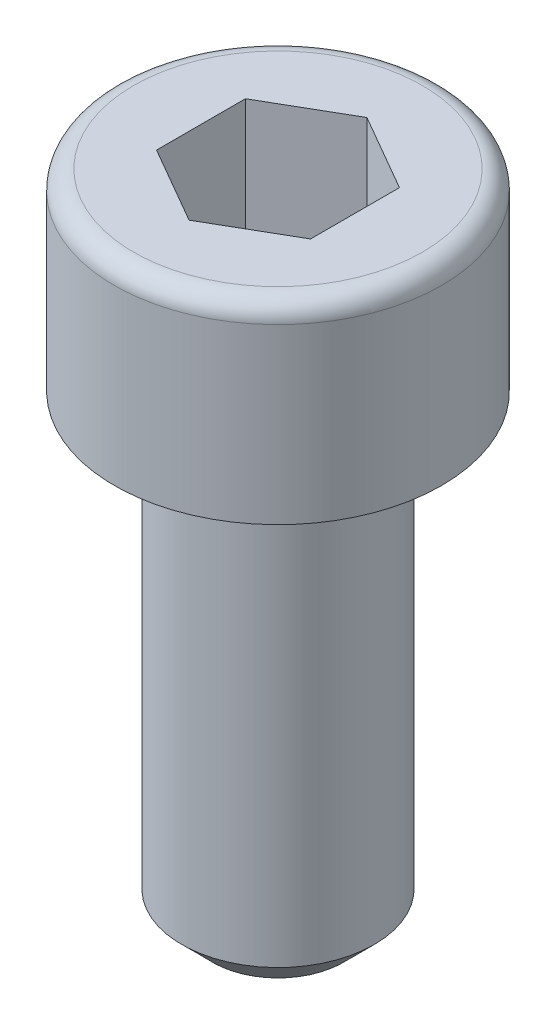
ISO-10303-21;
HEADER;
FILE_DESCRIPTION(('STEP AP214'),'2;1');
FILE_NAME('part.step','',(''),(''),'','','');
FILE_SCHEMA(('AUTOMOTIVE_DESIGN { 1 0 10303 214 1 1 1 1 }'));
ENDSEC;
DATA;
#1=APPLICATION_CONTEXT('core data for automotive mechanical design processes');
#2=APPLICATION_PROTOCOL_DEFINITION('international standard','automotive_design',2000,#1);
#3=PRODUCT_CONTEXT('',#1,'mechanical');
#4=PRODUCT('Part','Part','',(#3));
#5=PRODUCT_RELATED_PRODUCT_CATEGORY('part','',(#4));
#6=PRODUCT_DEFINITION_FORMATION('','',#4);
#7=PRODUCT_DEFINITION_CONTEXT('part definition',#1,'design');
#8=PRODUCT_DEFINITION('design','',#6,#7);
#9=PRODUCT_DEFINITION_SHAPE('','',#8);
#10=(LENGTH_UNIT() NAMED_UNIT(*) SI_UNIT(.MILLI.,.METRE.));
#11=(NAMED_UNIT(*) PLANE_ANGLE_UNIT() SI_UNIT($,.RADIAN.));
#12=(NAMED_UNIT(*) SI_UNIT($,.STERADIAN.) SOLID_ANGLE_UNIT());
#13=UNCERTAINTY_MEASURE_WITH_UNIT(LENGTH_MEASURE(1.E-05),#10,'distance_accuracy_value','');
#14=(GEOMETRIC_REPRESENTATION_CONTEXT(3) GLOBAL_UNCERTAINTY_ASSIGNED_CONTEXT((#13)) GLOBAL_UNIT_ASSIGNED_CONTEXT((#10,
#11,#12)) REPRESENTATION_CONTEXT('',''));
#15=CARTESIAN_POINT('',(0.,0.,0.));
#16=DIRECTION('',(0.,0.,1.));
#17=DIRECTION('',(1.,0.,0.));
#18=AXIS2_PLACEMENT_3D('',#15,#16,#17);
#19=CARTESIAN_POINT('',(1.70000000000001,-17.,0.));
#20=DIRECTION('',(0.,-1.,0.));
#21=DIRECTION('',(1.,0.,0.));
#22=AXIS2_PLACEMENT_3D('',#19,#20,#21);
#23=PLANE('',#22);
#24=CARTESIAN_POINT('',(0.,-17.,0.));
#25=DIRECTION('',(0.,1.,0.));
#26=DIRECTION('',(-1.,0.,0.));
#27=AXIS2_PLACEMENT_3D('',#24,#25,#26);
#28=CIRCLE('',#27,1.7);
#29=CARTESIAN_POINT('',(-1.69999999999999,-17.,0.));
#30=VERTEX_POINT('',#29);
#31=EDGE_CURVE('E11',#30,#30,#28,.T.);
#32=ORIENTED_EDGE('',*,*,#31,.F.);
#33=EDGE_LOOP('',(#32));
#34=FACE_BOUND('',#33,.T.);
#35=ADVANCED_FACE('F32',(#34),#23,.T.);
#36=CARTESIAN_POINT('',(0.,-17.,0.));
#37=DIRECTION('',(0.,1.,0.));
#38=DIRECTION('',(-1.,0.,0.));
#39=AXIS2_PLACEMENT_3D('',#36,#37,#38);
#40=CONICAL_SURFACE('',#39,1.7,0.785398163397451);
#41=CARTESIAN_POINT('',(0.,-16.2,0.));
#42=DIRECTION('',(0.,1.,0.));
#43=DIRECTION('',(-1.,0.,0.));
#44=AXIS2_PLACEMENT_3D('',#41,#42,#43);
#45=CIRCLE('',#44,2.5);
#46=CARTESIAN_POINT('',(-2.49999999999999,-16.2,0.));
#47=VERTEX_POINT('',#46);
#48=EDGE_CURVE('E39',#47,#47,#45,.T.);
#49=ORIENTED_EDGE('',*,*,#48,.F.);
#50=EDGE_LOOP('',(#49));
#51=FACE_BOUND('',#50,.T.);
#52=ORIENTED_EDGE('',*,*,#31,.T.);
#53=EDGE_LOOP('',(#52));
#54=FACE_BOUND('',#53,.T.);
#55=ADVANCED_FACE('F134',(#51,#54),#40,.T.);
#56=CARTESIAN_POINT('',(0.,65.1172922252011,0.));
#57=DIRECTION('',(0.,1.,0.));
#58=DIRECTION('',(-1.,0.,0.));
#59=AXIS2_PLACEMENT_3D('',#56,#57,#58);
#60=CYLINDRICAL_SURFACE('',#59,2.49999999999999);
#61=ORIENTED_EDGE('',*,*,#48,.T.);
#62=EDGE_LOOP('',(#61));
#63=FACE_BOUND('',#62,.T.);
#64=CARTESIAN_POINT('',(0.,-5.,0.));
#65=DIRECTION('',(0.,1.,0.));
#66=DIRECTION('',(-1.,0.,0.));
#67=AXIS2_PLACEMENT_3D('',#64,#65,#66);
#68=CIRCLE('',#67,2.49999999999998);
#69=CARTESIAN_POINT('',(-2.49999999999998,-5.00000000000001,0.));
#70=VERTEX_POINT('',#69);
#71=EDGE_CURVE('E126',#70,#70,#68,.T.);
#72=ORIENTED_EDGE('',*,*,#71,.F.);
#73=EDGE_LOOP('',(#72));
#74=FACE_BOUND('',#73,.T.);
#75=ADVANCED_FACE('F131',(#63,#74),#60,.T.);
#76=CARTESIAN_POINT('',(2.49999999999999,-5.,0.));
#77=DIRECTION('',(0.,1.,0.));
#78=DIRECTION('',(-1.,0.,0.));
#79=AXIS2_PLACEMENT_3D('',#76,#77,#78);
#80=PLANE('',#79);
#81=CARTESIAN_POINT('',(0.,-5.,0.));
#82=DIRECTION('',(0.,1.,0.));
#83=DIRECTION('',(-1.,0.,0.));
#84=AXIS2_PLACEMENT_3D('',#81,#82,#83);
#85=CIRCLE('',#84,4.24999999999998);
#86=CARTESIAN_POINT('',(-4.24999999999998,-5.00000000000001,0.));
#87=VERTEX_POINT('',#86);
#88=EDGE_CURVE('E123',#87,#87,#85,.T.);
#89=ORIENTED_EDGE('',*,*,#88,.F.);
#90=EDGE_LOOP('',(#89));
#91=FACE_BOUND('',#90,.T.);
#92=ORIENTED_EDGE('',*,*,#71,.T.);
#93=EDGE_LOOP('',(#92));
#94=FACE_BOUND('',#93,.T.);
#95=ADVANCED_FACE('F152',(#91,#94),#80,.F.);
#96=CARTESIAN_POINT('',(0.,65.1172922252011,0.));
#97=DIRECTION('',(0.,1.,0.));
#98=DIRECTION('',(-1.,0.,0.));
#99=AXIS2_PLACEMENT_3D('',#96,#97,#98);
#100=CYLINDRICAL_SURFACE('',#99,4.24999999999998);
#101=CARTESIAN_POINT('',(0.,-0.5,0.));
#102=DIRECTION('',(0.,1.,0.));
#103=DIRECTION('',(-1.,0.,0.));
#104=AXIS2_PLACEMENT_3D('',#101,#102,#103);
#105=CIRCLE('',#104,4.24999999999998);
#106=CARTESIAN_POINT('',(-4.24999999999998,-0.500000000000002,0.));
#107=VERTEX_POINT('',#106);
#108=EDGE_CURVE('E120',#107,#107,#105,.T.);
#109=ORIENTED_EDGE('',*,*,#108,.F.);
#110=EDGE_LOOP('',(#109));
#111=FACE_BOUND('',#110,.T.);
#112=ORIENTED_EDGE('',*,*,#88,.T.);
#113=EDGE_LOOP('',(#112));
#114=FACE_BOUND('',#113,.T.);
#115=ADVANCED_FACE('F159',(#111,#114),#100,.T.);
#116=CARTESIAN_POINT('',(0.,-0.5,0.));
#117=DIRECTION('',(0.,1.,0.));
#118=DIRECTION('',(-1.,0.,0.));
#119=AXIS2_PLACEMENT_3D('',#116,#117,#118);
#120=TOROIDAL_SURFACE('',#119,3.74999999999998,0.5);
#121=CARTESIAN_POINT('',(0.,0.,0.));
#122=DIRECTION('',(0.,1.,0.));
#123=DIRECTION('',(-1.,0.,0.));
#124=AXIS2_PLACEMENT_3D('',#121,#122,#123);
#125=CIRCLE('',#124,3.74999999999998);
#126=CARTESIAN_POINT('',(-3.74999999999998,0.,0.));
#127=VERTEX_POINT('',#126);
#128=EDGE_CURVE('E109',#127,#127,#125,.T.);
#129=ORIENTED_EDGE('',*,*,#128,.F.);
#130=EDGE_LOOP('',(#129));
#131=FACE_BOUND('',#130,.T.);
#132=ORIENTED_EDGE('',*,*,#108,.T.);
#133=EDGE_LOOP('',(#132));
#134=FACE_BOUND('',#133,.T.);
#135=ADVANCED_FACE('F167',(#131,#134),#120,.T.);
#136=CARTESIAN_POINT('',(3.75,0.,0.));
#137=DIRECTION('',(0.,-1.,0.));
#138=DIRECTION('',(1.,0.,0.));
#139=AXIS2_PLACEMENT_3D('',#136,#137,#138);
#140=PLANE('',#139);
#141=DIRECTION('',(0.,0.,1.));
#142=VECTOR('',#141,1.);
#143=CARTESIAN_POINT('',(-2.,0.,-1.15470053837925));
#144=LINE('',#143,#142);
#145=CARTESIAN_POINT('',(-2.,0.,-1.15470053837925));
#146=VERTEX_POINT('',#145);
#147=CARTESIAN_POINT('',(-2.,0.,1.15470053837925));
#148=VERTEX_POINT('',#147);
#149=EDGE_CURVE('E343',#146,#148,#144,.T.);
#150=ORIENTED_EDGE('',*,*,#149,.F.);
#151=DIRECTION('',(-0.866025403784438,0.,0.500000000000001));
#152=VECTOR('',#151,1.);
#153=CARTESIAN_POINT('',(0.,0.,-2.3094010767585));
#154=LINE('',#153,#152);
#155=CARTESIAN_POINT('',(0.,0.,-2.3094010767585));
#156=VERTEX_POINT('',#155);
#157=EDGE_CURVE('E46',#156,#146,#154,.T.);
#158=ORIENTED_EDGE('',*,*,#157,.F.);
#159=DIRECTION('',(0.866025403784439,0.,0.500000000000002));
#160=VECTOR('',#159,1.);
#161=CARTESIAN_POINT('',(0.,0.,-2.3094010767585));
#162=LINE('',#161,#160);
#163=CARTESIAN_POINT('',(2.,0.,-1.15470053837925));
#164=VERTEX_POINT('',#163);
#165=EDGE_CURVE('E82',#156,#164,#162,.T.);
#166=ORIENTED_EDGE('',*,*,#165,.T.);
#167=DIRECTION('',(0.,0.,1.));
#168=VECTOR('',#167,1.);
#169=CARTESIAN_POINT('',(2.,0.,-1.15470053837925));
#170=LINE('',#169,#168);
#171=CARTESIAN_POINT('',(2.,0.,1.15470053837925));
#172=VERTEX_POINT('',#171);
#173=EDGE_CURVE('E91',#164,#172,#170,.T.);
#174=ORIENTED_EDGE('',*,*,#173,.T.);
#175=DIRECTION('',(-0.866025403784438,0.,0.500000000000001));
#176=VECTOR('',#175,1.);
#177=CARTESIAN_POINT('',(2.,0.,1.15470053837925));
#178=LINE('',#177,#176);
#179=CARTESIAN_POINT('',(0.,0.,2.3094010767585));
#180=VERTEX_POINT('',#179);
#181=EDGE_CURVE('E97',#172,#180,#178,.T.);
#182=ORIENTED_EDGE('',*,*,#181,.T.);
#183=DIRECTION('',(0.866025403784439,0.,0.500000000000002));
#184=VECTOR('',#183,1.);
#185=CARTESIAN_POINT('',(-2.,0.,1.15470053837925));
#186=LINE('',#185,#184);
#187=EDGE_CURVE('E355',#148,#180,#186,.T.);
#188=ORIENTED_EDGE('',*,*,#187,.F.);
#189=EDGE_LOOP('',(#150,#158,#166,#174,#182,#188));
#190=FACE_BOUND('',#189,.T.);
#191=ORIENTED_EDGE('',*,*,#128,.T.);
#192=EDGE_LOOP('',(#191));
#193=FACE_BOUND('',#192,.T.);
#194=ADVANCED_FACE('F100',(#190,#193),#140,.F.);
#195=CARTESIAN_POINT('',(0.,-3.6,-2.3094010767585));
#196=DIRECTION('',(-0.500000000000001,0.,-0.866025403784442));
#197=DIRECTION('',(-0.866025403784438,0.,0.500000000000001));
#198=AXIS2_PLACEMENT_3D('',#195,#196,#197);
#199=PLANE('',#198);
#200=ORIENTED_EDGE('',*,*,#157,.T.);
#201=DIRECTION('',(0.,1.,0.));
#202=VECTOR('',#201,1.);
#203=CARTESIAN_POINT('',(-2.,-3.6,-1.15470053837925));
#204=LINE('',#203,#202);
#205=CARTESIAN_POINT('',(-2.,-3.6,-1.15470053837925));
#206=VERTEX_POINT('',#205);
#207=EDGE_CURVE('E116',#206,#146,#204,.T.);
#208=ORIENTED_EDGE('',*,*,#207,.F.);
#209=DIRECTION('',(-0.866025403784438,0.,0.500000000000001));
#210=VECTOR('',#209,1.);
#211=CARTESIAN_POINT('',(0.,-3.6,-2.3094010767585));
#212=LINE('',#211,#210);
#213=CARTESIAN_POINT('',(0.,-3.6,-2.3094010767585));
#214=VERTEX_POINT('',#213);
#215=EDGE_CURVE('E102',#214,#206,#212,.T.);
#216=ORIENTED_EDGE('',*,*,#215,.F.);
#217=DIRECTION('',(0.,1.,0.));
#218=VECTOR('',#217,1.);
#219=CARTESIAN_POINT('',(0.,-3.6,-2.3094010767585));
#220=LINE('',#219,#218);
#221=EDGE_CURVE('E87',#214,#156,#220,.T.);
#222=ORIENTED_EDGE('',*,*,#221,.T.);
#223=EDGE_LOOP('',(#200,#208,#216,#222));
#224=FACE_BOUND('',#223,.T.);
#225=ADVANCED_FACE('F182',(#224),#199,.F.);
#226=CARTESIAN_POINT('',(0.,-3.6,-2.3094010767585));
#227=DIRECTION('',(-0.499999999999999,0.,0.866025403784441));
#228=DIRECTION('',(0.866025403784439,0.,0.500000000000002));
#229=AXIS2_PLACEMENT_3D('',#226,#227,#228);
#230=PLANE('',#229);
#231=ORIENTED_EDGE('',*,*,#165,.F.);
#232=ORIENTED_EDGE('',*,*,#221,.F.);
#233=DIRECTION('',(0.866025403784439,0.,0.500000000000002));
#234=VECTOR('',#233,1.);
#235=CARTESIAN_POINT('',(0.,-3.6,-2.3094010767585));
#236=LINE('',#235,#234);
#237=CARTESIAN_POINT('',(2.,-3.6,-1.15470053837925));
#238=VERTEX_POINT('',#237);
#239=EDGE_CURVE('E84',#214,#238,#236,.T.);
#240=ORIENTED_EDGE('',*,*,#239,.T.);
#241=DIRECTION('',(0.,1.,0.));
#242=VECTOR('',#241,1.);
#243=CARTESIAN_POINT('',(2.,-3.6,-1.15470053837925));
#244=LINE('',#243,#242);
#245=EDGE_CURVE('E77',#238,#164,#244,.T.);
#246=ORIENTED_EDGE('',*,*,#245,.T.);
#247=EDGE_LOOP('',(#231,#232,#240,#246));
#248=FACE_BOUND('',#247,.T.);
#249=ADVANCED_FACE('F79',(#248),#230,.T.);
#250=CARTESIAN_POINT('',(2.,-3.6,-1.15470053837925));
#251=DIRECTION('',(-1.,0.,0.));
#252=DIRECTION('',(0.,-1.,0.));
#253=AXIS2_PLACEMENT_3D('',#250,#251,#252);
#254=PLANE('',#253);
#255=ORIENTED_EDGE('',*,*,#173,.F.);
#256=ORIENTED_EDGE('',*,*,#245,.F.);
#257=DIRECTION('',(0.,0.,1.));
#258=VECTOR('',#257,1.);
#259=CARTESIAN_POINT('',(2.,-3.6,-1.15470053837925));
#260=LINE('',#259,#258);
#261=CARTESIAN_POINT('',(2.,-3.6,1.15470053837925));
#262=VERTEX_POINT('',#261);
#263=EDGE_CURVE('E340',#238,#262,#260,.T.);
#264=ORIENTED_EDGE('',*,*,#263,.T.);
#265=DIRECTION('',(0.,1.,0.));
#266=VECTOR('',#265,1.);
#267=CARTESIAN_POINT('',(2.,-3.6,1.15470053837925));
#268=LINE('',#267,#266);
#269=EDGE_CURVE('E88',#262,#172,#268,.T.);
#270=ORIENTED_EDGE('',*,*,#269,.T.);
#271=EDGE_LOOP('',(#255,#256,#264,#270));
#272=FACE_BOUND('',#271,.T.);
#273=ADVANCED_FACE('F92',(#272),#254,.T.);
#274=CARTESIAN_POINT('',(2.,-3.6,1.15470053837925));
#275=DIRECTION('',(-0.500000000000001,0.,-0.866025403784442));
#276=DIRECTION('',(-0.866025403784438,0.,0.500000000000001));
#277=AXIS2_PLACEMENT_3D('',#274,#275,#276);
#278=PLANE('',#277);
#279=ORIENTED_EDGE('',*,*,#181,.F.);
#280=ORIENTED_EDGE('',*,*,#269,.F.);
#281=DIRECTION('',(-0.866025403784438,0.,0.500000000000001));
#282=VECTOR('',#281,1.);
#283=CARTESIAN_POINT('',(2.,-3.6,1.15470053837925));
#284=LINE('',#283,#282);
#285=CARTESIAN_POINT('',(0.,-3.6,2.3094010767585));
#286=VERTEX_POINT('',#285);
#287=EDGE_CURVE('E321',#262,#286,#284,.T.);
#288=ORIENTED_EDGE('',*,*,#287,.T.);
#289=DIRECTION('',(0.,1.,0.));
#290=VECTOR('',#289,1.);
#291=CARTESIAN_POINT('',(0.,-3.6,2.3094010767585));
#292=LINE('',#291,#290);
#293=EDGE_CURVE('E112',#286,#180,#292,.T.);
#294=ORIENTED_EDGE('',*,*,#293,.T.);
#295=EDGE_LOOP('',(#279,#280,#288,#294));
#296=FACE_BOUND('',#295,.T.);
#297=ADVANCED_FACE('F201',(#296),#278,.T.);
#298=CARTESIAN_POINT('',(-2.,-3.6,1.15470053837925));
#299=DIRECTION('',(-0.499999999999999,0.,0.86602540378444));
#300=DIRECTION('',(0.866025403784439,0.,0.500000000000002));
#301=AXIS2_PLACEMENT_3D('',#298,#299,#300);
#302=PLANE('',#301);
#303=ORIENTED_EDGE('',*,*,#187,.T.);
#304=ORIENTED_EDGE('',*,*,#293,.F.);
#305=DIRECTION('',(0.866025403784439,0.,0.500000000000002));
#306=VECTOR('',#305,1.);
#307=CARTESIAN_POINT('',(-2.,-3.6,1.15470053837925));
#308=LINE('',#307,#306);
#309=CARTESIAN_POINT('',(-2.,-3.6,1.15470053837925));
#310=VERTEX_POINT('',#309);
#311=EDGE_CURVE('E55',#310,#286,#308,.T.);
#312=ORIENTED_EDGE('',*,*,#311,.F.);
#313=DIRECTION('',(0.,1.,0.));
#314=VECTOR('',#313,1.);
#315=CARTESIAN_POINT('',(-2.,-3.6,1.15470053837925));
#316=LINE('',#315,#314);
#317=EDGE_CURVE('E114',#310,#148,#316,.T.);
#318=ORIENTED_EDGE('',*,*,#317,.T.);
#319=EDGE_LOOP('',(#303,#304,#312,#318));
#320=FACE_BOUND('',#319,.T.);
#321=ADVANCED_FACE('F208',(#320),#302,.F.);
#322=CARTESIAN_POINT('',(-2.,-3.6,-1.15470053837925));
#323=DIRECTION('',(-1.,0.,0.));
#324=DIRECTION('',(0.,-1.,0.));
#325=AXIS2_PLACEMENT_3D('',#322,#323,#324);
#326=PLANE('',#325);
#327=ORIENTED_EDGE('',*,*,#149,.T.);
#328=ORIENTED_EDGE('',*,*,#317,.F.);
#329=DIRECTION('',(0.,0.,1.));
#330=VECTOR('',#329,1.);
#331=CARTESIAN_POINT('',(-2.,-3.6,-1.15470053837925));
#332=LINE('',#331,#330);
#333=EDGE_CURVE('E105',#206,#310,#332,.T.);
#334=ORIENTED_EDGE('',*,*,#333,.F.);
#335=ORIENTED_EDGE('',*,*,#207,.T.);
#336=EDGE_LOOP('',(#327,#328,#334,#335));
#337=FACE_BOUND('',#336,.T.);
#338=ADVANCED_FACE('F216',(#337),#326,.F.);
#339=CARTESIAN_POINT('',(-2.,-3.6,-1.15470053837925));
#340=DIRECTION('',(0.0980580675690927,0.98058067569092,0.16984155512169));
#341=DIRECTION('',(0.,-0.170664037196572,0.985329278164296));
#342=AXIS2_PLACEMENT_3D('',#339,#340,#341);
#343=PLANE('',#342);
#344=DIRECTION('',(-0.853320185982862,0.170664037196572,-0.492664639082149));
#345=VECTOR('',#344,1.);
#346=CARTESIAN_POINT('',(0.,-4.,0.));
#347=LINE('',#346,#345);
#348=CARTESIAN_POINT('',(0.,-4.,0.));
#349=VERTEX_POINT('',#348);
#350=EDGE_CURVE('E330',#349,#206,#347,.T.);
#351=ORIENTED_EDGE('',*,*,#350,.F.);
#352=DIRECTION('',(0.,0.170664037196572,-0.985329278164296));
#353=VECTOR('',#352,1.);
#354=CARTESIAN_POINT('',(0.,-4.,0.));
#355=LINE('',#354,#353);
#356=EDGE_CURVE('E332',#349,#214,#355,.T.);
#357=ORIENTED_EDGE('',*,*,#356,.T.);
#358=ORIENTED_EDGE('',*,*,#215,.T.);
#359=EDGE_LOOP('',(#351,#357,#358));
#360=FACE_BOUND('',#359,.T.);
#361=ADVANCED_FACE('F224',(#360),#343,.T.);
#362=CARTESIAN_POINT('',(0.,-3.6,-2.3094010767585));
#363=DIRECTION('',(-0.0980580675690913,0.98058067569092,0.16984155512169));
#364=DIRECTION('',(0.,-0.170664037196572,0.985329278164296));
#365=AXIS2_PLACEMENT_3D('',#362,#363,#364);
#366=PLANE('',#365);
#367=ORIENTED_EDGE('',*,*,#356,.F.);
#368=DIRECTION('',(0.853320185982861,0.170664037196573,-0.492664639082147));
#369=VECTOR('',#368,1.);
#370=CARTESIAN_POINT('',(0.,-4.,0.));
#371=LINE('',#370,#369);
#372=EDGE_CURVE('E337',#349,#238,#371,.T.);
#373=ORIENTED_EDGE('',*,*,#372,.T.);
#374=ORIENTED_EDGE('',*,*,#239,.F.);
#375=EDGE_LOOP('',(#367,#373,#374));
#376=FACE_BOUND('',#375,.T.);
#377=ADVANCED_FACE('F233',(#376),#366,.T.);
#378=CARTESIAN_POINT('',(-2.,-3.6,1.15470053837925));
#379=DIRECTION('',(0.196116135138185,0.98058067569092,0.));
#380=DIRECTION('',(-0.98058067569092,0.196116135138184,0.));
#381=AXIS2_PLACEMENT_3D('',#378,#379,#380);
#382=PLANE('',#381);
#383=DIRECTION('',(-0.853320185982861,0.170664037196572,0.492664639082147));
#384=VECTOR('',#383,1.);
#385=CARTESIAN_POINT('',(0.,-4.,0.));
#386=LINE('',#385,#384);
#387=EDGE_CURVE('E326',#349,#310,#386,.T.);
#388=ORIENTED_EDGE('',*,*,#387,.F.);
#389=ORIENTED_EDGE('',*,*,#350,.T.);
#390=ORIENTED_EDGE('',*,*,#333,.T.);
#391=EDGE_LOOP('',(#388,#389,#390));
#392=FACE_BOUND('',#391,.T.);
#393=ADVANCED_FACE('F241',(#392),#382,.T.);
#394=CARTESIAN_POINT('',(2.,-3.6,-1.15470053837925));
#395=DIRECTION('',(-0.196116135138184,0.98058067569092,0.));
#396=DIRECTION('',(-0.98058067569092,-0.196116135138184,0.));
#397=AXIS2_PLACEMENT_3D('',#394,#395,#396);
#398=PLANE('',#397);
#399=ORIENTED_EDGE('',*,*,#372,.F.);
#400=DIRECTION('',(0.853320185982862,0.170664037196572,0.492664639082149));
#401=VECTOR('',#400,1.);
#402=CARTESIAN_POINT('',(0.,-4.,0.));
#403=LINE('',#402,#401);
#404=EDGE_CURVE('E316',#349,#262,#403,.T.);
#405=ORIENTED_EDGE('',*,*,#404,.T.);
#406=ORIENTED_EDGE('',*,*,#263,.F.);
#407=EDGE_LOOP('',(#399,#405,#406));
#408=FACE_BOUND('',#407,.T.);
#409=ADVANCED_FACE('F249',(#408),#398,.T.);
#410=CARTESIAN_POINT('',(0.,-3.6,2.3094010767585));
#411=DIRECTION('',(0.0980580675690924,0.98058067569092,-0.16984155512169));
#412=DIRECTION('',(0.,0.170664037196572,0.985329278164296));
#413=AXIS2_PLACEMENT_3D('',#410,#411,#412);
#414=PLANE('',#413);
#415=DIRECTION('',(0.,0.170664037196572,0.985329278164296));
#416=VECTOR('',#415,1.);
#417=CARTESIAN_POINT('',(0.,-4.,0.));
#418=LINE('',#417,#416);
#419=EDGE_CURVE('E318',#349,#286,#418,.T.);
#420=ORIENTED_EDGE('',*,*,#419,.F.);
#421=ORIENTED_EDGE('',*,*,#387,.T.);
#422=ORIENTED_EDGE('',*,*,#311,.T.);
#423=EDGE_LOOP('',(#420,#421,#422));
#424=FACE_BOUND('',#423,.T.);
#425=ADVANCED_FACE('F257',(#424),#414,.T.);
#426=CARTESIAN_POINT('',(2.,-3.6,1.15470053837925));
#427=DIRECTION('',(-0.0980580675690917,0.98058067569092,-0.16984155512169));
#428=DIRECTION('',(0.,0.170664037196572,0.985329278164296));
#429=AXIS2_PLACEMENT_3D('',#426,#427,#428);
#430=PLANE('',#429);
#431=ORIENTED_EDGE('',*,*,#404,.F.);
#432=ORIENTED_EDGE('',*,*,#419,.T.);
#433=ORIENTED_EDGE('',*,*,#287,.F.);
#434=EDGE_LOOP('',(#431,#432,#433));
#435=FACE_BOUND('',#434,.T.);
#436=ADVANCED_FACE('F227',(#435),#430,.T.);
#437=CLOSED_SHELL('',(#35,#55,#75,#95,#115,#135,#194,#225,#249,#273,#297,#321,#338,#361,#377,
#393,#409,#425,#436));
#438=MANIFOLD_SOLID_BREP('B2',#437);
#439=ADVANCED_BREP_SHAPE_REPRESENTATION('',(#18,#438),#14);
#440=SHAPE_DEFINITION_REPRESENTATION(#9,#439);
ENDSEC;
END-ISO-10303-21;
